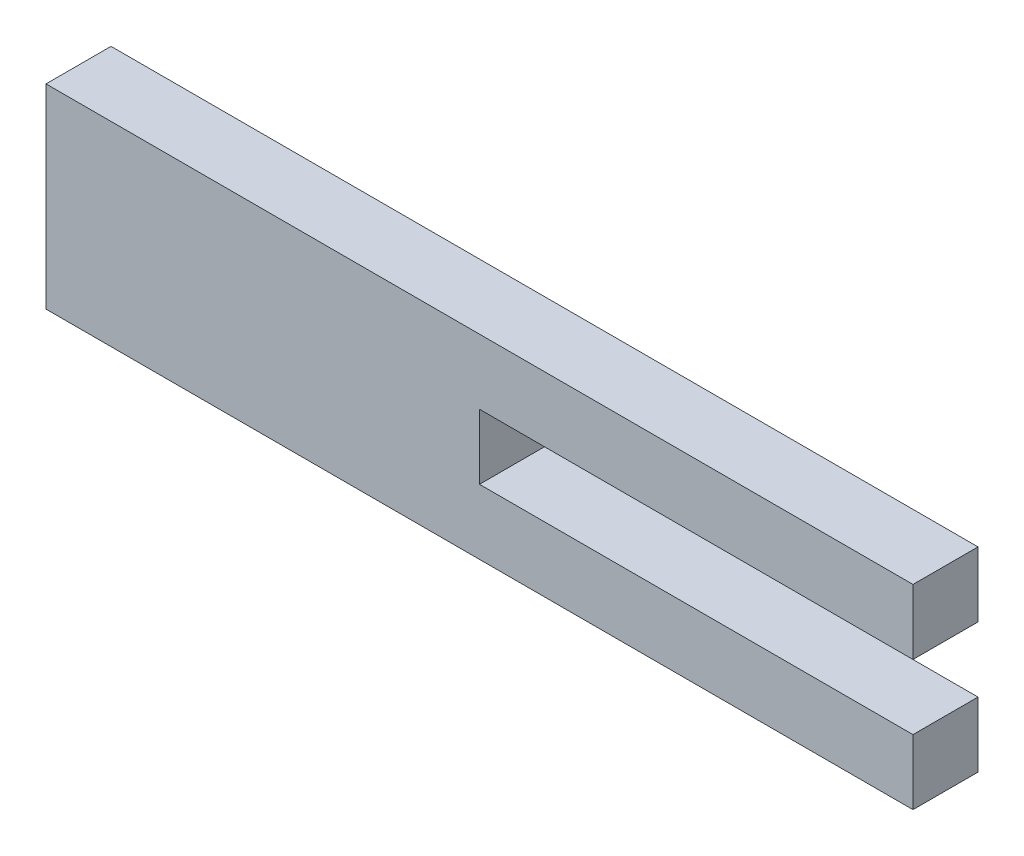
from build123d import *

# Parameters (mm, degrees)
CROQUIS1_W              = 40
CROQUIS1_H              = 9
SALIENTE_EXTRUIR1_DEPTH = 3
CROQUIS2_W              = 20
CROQUIS2_H              = 3
CORTAR_EXTRUIR1_DEPTH   = 3


with BuildPart() as part:
    # Croquis1 → Saliente-Extruir1 (new body)
    with BuildSketch(Plane.XY):
        Rectangle(CROQUIS1_W, CROQUIS1_H)
    extrude(amount=SALIENTE_EXTRUIR1_DEPTH)

    # Croquis2 → Cortar-Extruir1 (cut)
    with BuildSketch(Plane.XY.offset(3)):
        with Locations((10, 0)):
            Rectangle(CROQUIS2_W, CROQUIS2_H)
    extrude(amount=-CORTAR_EXTRUIR1_DEPTH, mode=Mode.SUBTRACT)


solid = part.part
